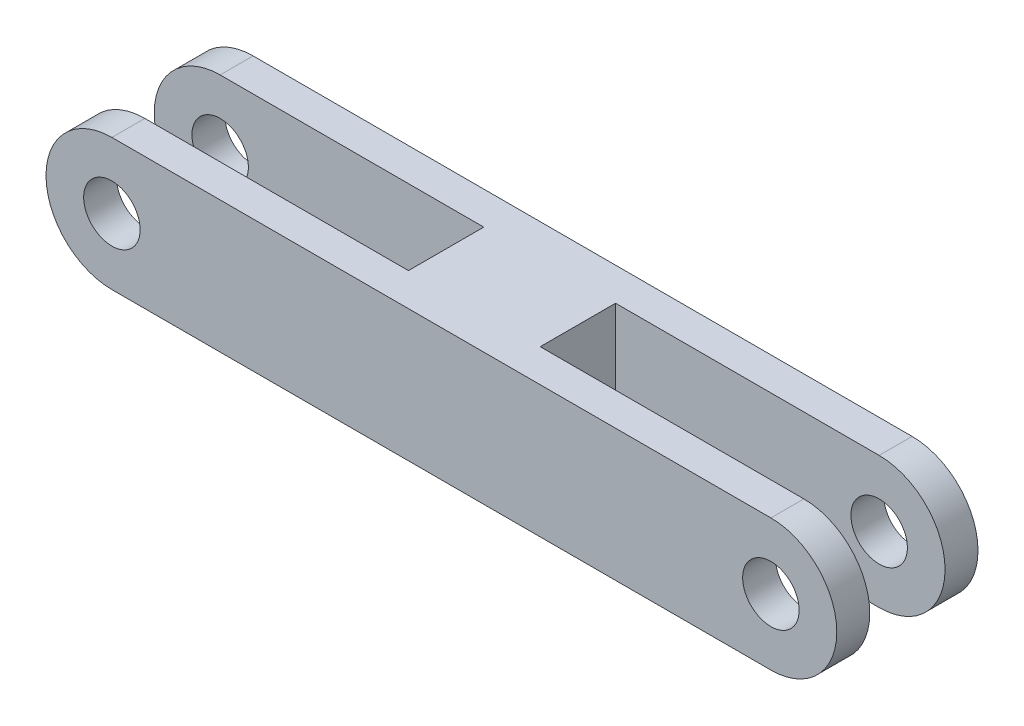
from build123d import *

# Parameters (mm, degrees)
SKETCH1_R          = 3
EXTRUDE1_DEPTH     = 7.5
SKETCH2_W          = 35
SKETCH2_H          = 8
CUT_EXTRUDE1_DEPTH = 79.620925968


with BuildPart() as part:
    # Sketch1 → Extrude1 (new, symmetric)
    with BuildSketch(Plane.XY):
        with BuildLine():
            Line((0, -7), (70, -7))
            ThreePointArc((70, -7), (77, 0), (70, 7))
            Line((70, 7), (0, 7))
            ThreePointArc((0, 7), (-7, 0), (0, -7))
        make_face()
        Circle(SKETCH1_R, mode=Mode.SUBTRACT)
        with Locations((70, 0)):
            Circle(SKETCH1_R, mode=Mode.SUBTRACT)
    extrude(amount=EXTRUDE1_DEPTH, both=True)

    # Sketch2 → Cut-Extrude1 (cut, through all)
    with BuildSketch(Plane(origin=(0, 7, 0), x_dir=(-1, 0, 0), z_dir=(0, 1, 0))):
        with Locations((-59.5, 0)):
            Rectangle(SKETCH2_W, SKETCH2_H)
        with Locations((-10.5, 0)):
            Rectangle(SKETCH2_W, SKETCH2_H)
    extrude(amount=-CUT_EXTRUDE1_DEPTH, mode=Mode.SUBTRACT)


solid = part.part
